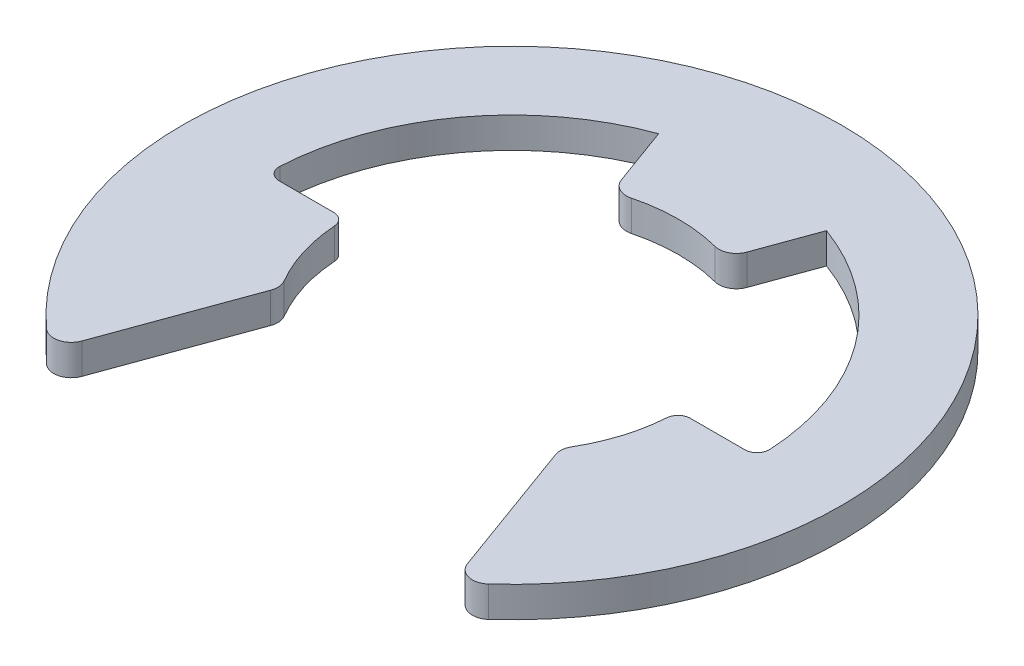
from build123d import *

# Parameters (mm, degrees)
BOSS_EXTRUDE1_DEPTH = 0.875
FILLET1_R           = 1
FILLET2_R           = 0.7


with BuildPart() as part:
    # Sketch2 → Boss-Extrude1 (new, symmetric)
    with BuildSketch(Plane(origin=(0, 0, 0), x_dir=(1, 0, 0), z_dir=(0, 1, 0))):
        with BuildLine():
            Line((-11.488916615, -14.881021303), (-7.96, -5.185402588))
            ThreePointArc((-7.96, -5.185402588), (-9.106865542, -2.704625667), (-9.5, 0))
            Line((-9.5, 0), (-14, 0))
            ThreePointArc((-14, 0), (-11.46812862, 8.030070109), (-4.788282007, 13.155696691))
            Line((-4.788282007, 13.155696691), (-3.249191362, 8.927079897))
            ThreePointArc((-3.249191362, 8.927079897), (0, 9.5), (3.249191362, 8.927079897))
            Line((3.249191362, 8.927079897), (4.788282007, 13.155696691))
            ThreePointArc((4.788282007, 13.155696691), (11.46812862, 8.030070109), (14, 0))
            Line((14, 0), (9.5, 0))
            ThreePointArc((9.5, 0), (9.106865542, -2.704625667), (7.96, -5.185402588))
            Line((7.96, -5.185402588), (11.488916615, -14.881021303))
            ThreePointArc((11.488916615, -14.881021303), (0, 18.8), (-11.488916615, -14.881021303))
        make_face()
    extrude(amount=BOSS_EXTRUDE1_DEPTH, both=True)

    # Fillet1
    fillet1_edges = [part.edges().sort_by_distance(p)[0] for p in [
        (-7.96, 0, 5.185402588),
        (-11.488916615, 0, 14.881021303),
        (11.488916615, 0, 14.881021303),
        (7.96, 0, 5.185402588),
        (3.249191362, 0, -8.927079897),
        (-3.249191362, 0, -8.927079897),
    ]]
    fillet(fillet1_edges, radius=FILLET1_R)

    # Fillet2
    fillet2_edges = [part.edges().sort_by_distance(p)[0] for p in [
        (-14, 0, 0),
        (-9.5, 0, 0),
        (9.5, 0, 0),
        (14, 0, 0),
    ]]
    fillet(fillet2_edges, radius=FILLET2_R)


solid = part.part
